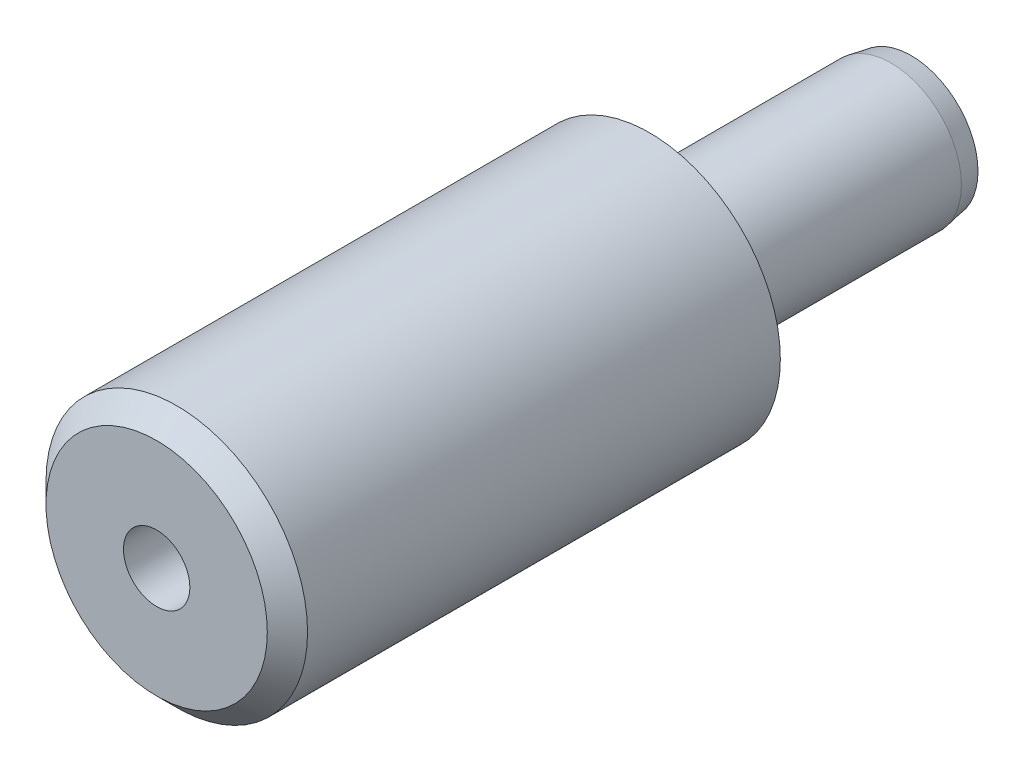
ISO-10303-21;
HEADER;
FILE_DESCRIPTION(('STEP AP214'),'2;1');
FILE_NAME('part.step','',(''),(''),'','','');
FILE_SCHEMA(('AUTOMOTIVE_DESIGN { 1 0 10303 214 1 1 1 1 }'));
ENDSEC;
DATA;
#1=APPLICATION_CONTEXT('core data for automotive mechanical design processes');
#2=APPLICATION_PROTOCOL_DEFINITION('international standard','automotive_design',2000,#1);
#3=PRODUCT_CONTEXT('',#1,'mechanical');
#4=PRODUCT('Part','Part','',(#3));
#5=PRODUCT_RELATED_PRODUCT_CATEGORY('part','',(#4));
#6=PRODUCT_DEFINITION_FORMATION('','',#4);
#7=PRODUCT_DEFINITION_CONTEXT('part definition',#1,'design');
#8=PRODUCT_DEFINITION('design','',#6,#7);
#9=PRODUCT_DEFINITION_SHAPE('','',#8);
#10=(LENGTH_UNIT() NAMED_UNIT(*) SI_UNIT(.MILLI.,.METRE.));
#11=(NAMED_UNIT(*) PLANE_ANGLE_UNIT() SI_UNIT($,.RADIAN.));
#12=(NAMED_UNIT(*) SI_UNIT($,.STERADIAN.) SOLID_ANGLE_UNIT());
#13=UNCERTAINTY_MEASURE_WITH_UNIT(LENGTH_MEASURE(1.E-05),#10,'distance_accuracy_value','');
#14=(GEOMETRIC_REPRESENTATION_CONTEXT(3) GLOBAL_UNCERTAINTY_ASSIGNED_CONTEXT((#13)) GLOBAL_UNIT_ASSIGNED_CONTEXT((#10,
#11,#12)) REPRESENTATION_CONTEXT('',''));
#15=CARTESIAN_POINT('',(0.,0.,0.));
#16=DIRECTION('',(0.,0.,1.));
#17=DIRECTION('',(1.,0.,0.));
#18=AXIS2_PLACEMENT_3D('',#15,#16,#17);
#19=CARTESIAN_POINT('',(0.,0.,0.5));
#20=DIRECTION('',(0.,0.,-1.));
#21=DIRECTION('',(-1.,0.,0.));
#22=AXIS2_PLACEMENT_3D('',#19,#20,#21);
#23=PLANE('',#22);
#24=CARTESIAN_POINT('',(0.,0.,0.5));
#25=DIRECTION('',(0.,0.,-1.));
#26=DIRECTION('',(-1.,0.,0.));
#27=AXIS2_PLACEMENT_3D('',#24,#25,#26);
#28=CIRCLE('',#27,4.3);
#29=CARTESIAN_POINT('',(-4.3,0.,0.5));
#30=VERTEX_POINT('',#29);
#31=EDGE_CURVE('E73',#30,#30,#28,.F.);
#32=ORIENTED_EDGE('',*,*,#31,.T.);
#33=EDGE_LOOP('',(#32));
#34=FACE_BOUND('',#33,.T.);
#35=CARTESIAN_POINT('',(0.,0.,0.5));
#36=DIRECTION('',(0.,0.,1.));
#37=DIRECTION('',(1.,0.,0.));
#38=AXIS2_PLACEMENT_3D('',#35,#36,#37);
#39=CIRCLE('',#38,6.5);
#40=CARTESIAN_POINT('',(6.5,0.,0.499999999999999));
#41=VERTEX_POINT('',#40);
#42=EDGE_CURVE('E70',#41,#41,#39,.T.);
#43=ORIENTED_EDGE('',*,*,#42,.F.);
#44=EDGE_LOOP('',(#43));
#45=FACE_BOUND('',#44,.T.);
#46=ADVANCED_FACE('F39',(#34,#45),#23,.T.);
#47=CARTESIAN_POINT('',(0.,0.,0.5));
#48=DIRECTION('',(0.,0.,1.));
#49=DIRECTION('',(1.,0.,0.));
#50=AXIS2_PLACEMENT_3D('',#47,#48,#49);
#51=CYLINDRICAL_SURFACE('',#50,6.5);
#52=CARTESIAN_POINT('',(0.,0.,24.));
#53=DIRECTION('',(0.,0.,1.));
#54=DIRECTION('',(1.,0.,0.));
#55=AXIS2_PLACEMENT_3D('',#52,#53,#54);
#56=CIRCLE('',#55,6.5);
#57=CARTESIAN_POINT('',(6.5,0.,24.));
#58=VERTEX_POINT('',#57);
#59=EDGE_CURVE('E11',#58,#58,#56,.F.);
#60=ORIENTED_EDGE('',*,*,#59,.T.);
#61=EDGE_LOOP('',(#60));
#62=FACE_BOUND('',#61,.T.);
#63=ORIENTED_EDGE('',*,*,#42,.T.);
#64=EDGE_LOOP('',(#63));
#65=FACE_BOUND('',#64,.T.);
#66=ADVANCED_FACE('F93',(#62,#65),#51,.T.);
#67=CARTESIAN_POINT('',(0.,0.,25.));
#68=DIRECTION('',(0.,0.,1.));
#69=DIRECTION('',(1.,0.,0.));
#70=AXIS2_PLACEMENT_3D('',#67,#68,#69);
#71=PLANE('',#70);
#72=CARTESIAN_POINT('',(0.,0.,25.));
#73=DIRECTION('',(0.,0.,1.));
#74=DIRECTION('',(1.,0.,0.));
#75=AXIS2_PLACEMENT_3D('',#72,#73,#74);
#76=CIRCLE('',#75,5.5);
#77=CARTESIAN_POINT('',(5.5,0.,25.));
#78=VERTEX_POINT('',#77);
#79=EDGE_CURVE('E46',#78,#78,#76,.T.);
#80=ORIENTED_EDGE('',*,*,#79,.T.);
#81=EDGE_LOOP('',(#80));
#82=FACE_BOUND('',#81,.T.);
#83=CARTESIAN_POINT('',(0.,0.,25.));
#84=DIRECTION('',(0.,0.,1.));
#85=DIRECTION('',(1.,0.,0.));
#86=AXIS2_PLACEMENT_3D('',#83,#84,#85);
#87=CIRCLE('',#86,1.64999999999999);
#88=CARTESIAN_POINT('',(1.64999999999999,0.,25.));
#89=VERTEX_POINT('',#88);
#90=EDGE_CURVE('E60',#89,#89,#87,.T.);
#91=ORIENTED_EDGE('',*,*,#90,.F.);
#92=EDGE_LOOP('',(#91));
#93=FACE_BOUND('',#92,.T.);
#94=ADVANCED_FACE('F81',(#82,#93),#71,.T.);
#95=CARTESIAN_POINT('',(0.,0.,-12.5));
#96=DIRECTION('',(0.,0.,1.));
#97=DIRECTION('',(1.,0.,0.));
#98=AXIS2_PLACEMENT_3D('',#95,#96,#97);
#99=CYLINDRICAL_SURFACE('',#98,3.5);
#100=CARTESIAN_POINT('',(0.,0.,-0.3));
#101=DIRECTION('',(0.,0.,-1.));
#102=DIRECTION('',(-1.,0.,0.));
#103=AXIS2_PLACEMENT_3D('',#100,#101,#102);
#104=CIRCLE('',#103,3.5);
#105=CARTESIAN_POINT('',(-3.5,0.,-0.299999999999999));
#106=VERTEX_POINT('',#105);
#107=EDGE_CURVE('E76',#106,#106,#104,.T.);
#108=ORIENTED_EDGE('',*,*,#107,.T.);
#109=EDGE_LOOP('',(#108));
#110=FACE_BOUND('',#109,.T.);
#111=CARTESIAN_POINT('',(0.,0.,-11.5));
#112=DIRECTION('',(0.,0.,1.));
#113=DIRECTION('',(1.,0.,0.));
#114=AXIS2_PLACEMENT_3D('',#111,#112,#113);
#115=CIRCLE('',#114,3.5);
#116=CARTESIAN_POINT('',(3.5,0.,-11.5));
#117=VERTEX_POINT('',#116);
#118=EDGE_CURVE('E63',#117,#117,#115,.T.);
#119=ORIENTED_EDGE('',*,*,#118,.T.);
#120=EDGE_LOOP('',(#119));
#121=FACE_BOUND('',#120,.T.);
#122=ADVANCED_FACE('F105',(#110,#121),#99,.T.);
#123=CARTESIAN_POINT('',(0.,0.,-11.5));
#124=DIRECTION('',(0.,0.,1.));
#125=DIRECTION('',(1.,0.,0.));
#126=AXIS2_PLACEMENT_3D('',#123,#124,#125);
#127=CONICAL_SURFACE('',#126,3.5,0.174532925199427);
#128=CARTESIAN_POINT('',(0.,0.,-12.5));
#129=DIRECTION('',(0.,0.,1.));
#130=DIRECTION('',(1.,0.,0.));
#131=AXIS2_PLACEMENT_3D('',#128,#129,#130);
#132=CIRCLE('',#131,3.32367301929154);
#133=CARTESIAN_POINT('',(3.32367301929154,0.,-12.5));
#134=VERTEX_POINT('',#133);
#135=EDGE_CURVE('E59',#134,#134,#132,.T.);
#136=ORIENTED_EDGE('',*,*,#135,.T.);
#137=EDGE_LOOP('',(#136));
#138=FACE_BOUND('',#137,.T.);
#139=ORIENTED_EDGE('',*,*,#118,.F.);
#140=EDGE_LOOP('',(#139));
#141=FACE_BOUND('',#140,.T.);
#142=ADVANCED_FACE('F108',(#138,#141),#127,.T.);
#143=CARTESIAN_POINT('',(0.,0.,-12.5));
#144=DIRECTION('',(0.,0.,-1.));
#145=DIRECTION('',(-1.,0.,0.));
#146=AXIS2_PLACEMENT_3D('',#143,#144,#145);
#147=PLANE('',#146);
#148=ORIENTED_EDGE('',*,*,#135,.F.);
#149=EDGE_LOOP('',(#148));
#150=FACE_BOUND('',#149,.T.);
#151=ADVANCED_FACE('F53',(#150),#147,.T.);
#152=CARTESIAN_POINT('',(0.,0.,12.));
#153=DIRECTION('',(0.,0.,1.));
#154=DIRECTION('',(1.,0.,0.));
#155=AXIS2_PLACEMENT_3D('',#152,#153,#154);
#156=CONICAL_SURFACE('',#155,1.65,1.02974425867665);
#157=CARTESIAN_POINT('',(0.,0.,11.0085799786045));
#158=VERTEX_POINT('',#157);
#159=VERTEX_LOOP('',#158);
#160=FACE_BOUND('',#159,.T.);
#161=CARTESIAN_POINT('',(0.,0.,12.));
#162=DIRECTION('',(0.,0.,1.));
#163=DIRECTION('',(1.,0.,0.));
#164=AXIS2_PLACEMENT_3D('',#161,#162,#163);
#165=CIRCLE('',#164,1.65);
#166=CARTESIAN_POINT('',(1.65,0.,12.));
#167=VERTEX_POINT('',#166);
#168=EDGE_CURVE('E57',#167,#167,#165,.T.);
#169=ORIENTED_EDGE('',*,*,#168,.T.);
#170=EDGE_LOOP('',(#169));
#171=FACE_BOUND('',#170,.T.);
#172=ADVANCED_FACE('F49',(#160,#171),#156,.F.);
#173=CARTESIAN_POINT('',(0.,0.,25.));
#174=DIRECTION('',(0.,0.,1.));
#175=DIRECTION('',(1.,0.,0.));
#176=AXIS2_PLACEMENT_3D('',#173,#174,#175);
#177=CYLINDRICAL_SURFACE('',#176,1.64999999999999);
#178=ORIENTED_EDGE('',*,*,#168,.F.);
#179=EDGE_LOOP('',(#178));
#180=FACE_BOUND('',#179,.T.);
#181=ORIENTED_EDGE('',*,*,#90,.T.);
#182=EDGE_LOOP('',(#181));
#183=FACE_BOUND('',#182,.T.);
#184=ADVANCED_FACE('F52',(#180,#183),#177,.F.);
#185=CARTESIAN_POINT('',(0.,0.,-0.3));
#186=DIRECTION('',(0.,0.,-1.));
#187=DIRECTION('',(-1.,0.,0.));
#188=AXIS2_PLACEMENT_3D('',#185,#186,#187);
#189=TOROIDAL_SURFACE('',#188,4.3,0.8);
#190=ORIENTED_EDGE('',*,*,#107,.F.);
#191=EDGE_LOOP('',(#190));
#192=FACE_BOUND('',#191,.T.);
#193=ORIENTED_EDGE('',*,*,#31,.F.);
#194=EDGE_LOOP('',(#193));
#195=FACE_BOUND('',#194,.T.);
#196=ADVANCED_FACE('F85',(#192,#195),#189,.F.);
#197=CARTESIAN_POINT('',(0.,0.,25.));
#198=DIRECTION('',(0.,0.,-1.));
#199=DIRECTION('',(-1.,0.,0.));
#200=AXIS2_PLACEMENT_3D('',#197,#198,#199);
#201=CONICAL_SURFACE('',#200,5.5,0.785398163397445);
#202=ORIENTED_EDGE('',*,*,#59,.F.);
#203=EDGE_LOOP('',(#202));
#204=FACE_BOUND('',#203,.T.);
#205=ORIENTED_EDGE('',*,*,#79,.F.);
#206=EDGE_LOOP('',(#205));
#207=FACE_BOUND('',#206,.T.);
#208=ADVANCED_FACE('F41',(#204,#207),#201,.T.);
#209=CLOSED_SHELL('',(#46,#66,#94,#122,#142,#151,#172,#184,#196,#208));
#210=MANIFOLD_SOLID_BREP('B2',#209);
#211=ADVANCED_BREP_SHAPE_REPRESENTATION('',(#18,#210),#14);
#212=SHAPE_DEFINITION_REPRESENTATION(#9,#211);
ENDSEC;
END-ISO-10303-21;
